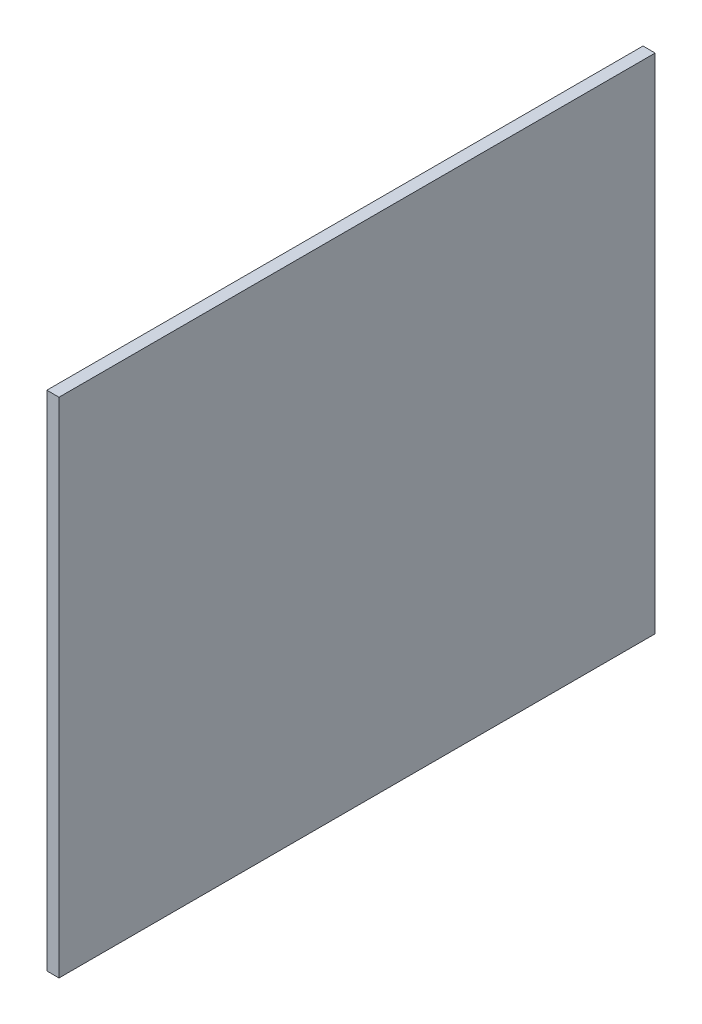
ISO-10303-21;
HEADER;
FILE_DESCRIPTION(('STEP AP214'),'2;1');
FILE_NAME('part.step','',(''),(''),'','','');
FILE_SCHEMA(('AUTOMOTIVE_DESIGN { 1 0 10303 214 1 1 1 1 }'));
ENDSEC;
DATA;
#1=APPLICATION_CONTEXT('core data for automotive mechanical design processes');
#2=APPLICATION_PROTOCOL_DEFINITION('international standard','automotive_design',2000,#1);
#3=PRODUCT_CONTEXT('',#1,'mechanical');
#4=PRODUCT('Part','Part','',(#3));
#5=PRODUCT_RELATED_PRODUCT_CATEGORY('part','',(#4));
#6=PRODUCT_DEFINITION_FORMATION('','',#4);
#7=PRODUCT_DEFINITION_CONTEXT('part definition',#1,'design');
#8=PRODUCT_DEFINITION('design','',#6,#7);
#9=PRODUCT_DEFINITION_SHAPE('','',#8);
#10=(LENGTH_UNIT() NAMED_UNIT(*) SI_UNIT(.MILLI.,.METRE.));
#11=(NAMED_UNIT(*) PLANE_ANGLE_UNIT() SI_UNIT($,.RADIAN.));
#12=(NAMED_UNIT(*) SI_UNIT($,.STERADIAN.) SOLID_ANGLE_UNIT());
#13=UNCERTAINTY_MEASURE_WITH_UNIT(LENGTH_MEASURE(1.E-05),#10,'distance_accuracy_value','');
#14=(GEOMETRIC_REPRESENTATION_CONTEXT(3) GLOBAL_UNCERTAINTY_ASSIGNED_CONTEXT((#13)) GLOBAL_UNIT_ASSIGNED_CONTEXT((#10,
#11,#12)) REPRESENTATION_CONTEXT('',''));
#15=CARTESIAN_POINT('',(0.,0.,0.));
#16=DIRECTION('',(0.,0.,1.));
#17=DIRECTION('',(1.,0.,0.));
#18=AXIS2_PLACEMENT_3D('',#15,#16,#17);
#19=CARTESIAN_POINT('',(12.7,0.,0.));
#20=DIRECTION('',(0.,0.,-1.));
#21=DIRECTION('',(-1.,0.,0.));
#22=AXIS2_PLACEMENT_3D('',#19,#20,#21);
#23=PLANE('',#22);
#24=DIRECTION('',(0.,-1.,0.));
#25=VECTOR('',#24,1.);
#26=CARTESIAN_POINT('',(0.,0.,0.));
#27=LINE('',#26,#25);
#28=CARTESIAN_POINT('',(0.,525.018,0.));
#29=VERTEX_POINT('',#28);
#30=CARTESIAN_POINT('',(0.,0.,0.));
#31=VERTEX_POINT('',#30);
#32=EDGE_CURVE('E83',#29,#31,#27,.T.);
#33=ORIENTED_EDGE('',*,*,#32,.T.);
#34=DIRECTION('',(-1.,0.,0.));
#35=VECTOR('',#34,1.);
#36=CARTESIAN_POINT('',(12.7,0.,0.));
#37=LINE('',#36,#35);
#38=CARTESIAN_POINT('',(12.7,0.,0.));
#39=VERTEX_POINT('',#38);
#40=EDGE_CURVE('E39',#39,#31,#37,.T.);
#41=ORIENTED_EDGE('',*,*,#40,.F.);
#42=DIRECTION('',(0.,-1.,0.));
#43=VECTOR('',#42,1.);
#44=CARTESIAN_POINT('',(12.7,0.,0.));
#45=LINE('',#44,#43);
#46=CARTESIAN_POINT('',(12.7,525.018,0.));
#47=VERTEX_POINT('',#46);
#48=EDGE_CURVE('E77',#47,#39,#45,.T.);
#49=ORIENTED_EDGE('',*,*,#48,.F.);
#50=DIRECTION('',(-1.,0.,0.));
#51=VECTOR('',#50,1.);
#52=CARTESIAN_POINT('',(12.7,525.018,0.));
#53=LINE('',#52,#51);
#54=EDGE_CURVE('E71',#47,#29,#53,.T.);
#55=ORIENTED_EDGE('',*,*,#54,.T.);
#56=EDGE_LOOP('',(#33,#41,#49,#55));
#57=FACE_BOUND('',#56,.T.);
#58=ADVANCED_FACE('F32',(#57),#23,.F.);
#59=CARTESIAN_POINT('',(12.7,0.,0.));
#60=DIRECTION('',(0.,1.,0.));
#61=DIRECTION('',(0.,0.,1.));
#62=AXIS2_PLACEMENT_3D('',#59,#60,#61);
#63=PLANE('',#62);
#64=DIRECTION('',(0.,0.,-1.));
#65=VECTOR('',#64,1.);
#66=CARTESIAN_POINT('',(0.,0.,0.));
#67=LINE('',#66,#65);
#68=CARTESIAN_POINT('',(0.,0.,-622.3));
#69=VERTEX_POINT('',#68);
#70=EDGE_CURVE('E78',#31,#69,#67,.T.);
#71=ORIENTED_EDGE('',*,*,#70,.T.);
#72=DIRECTION('',(1.,0.,0.));
#73=VECTOR('',#72,1.);
#74=CARTESIAN_POINT('',(12.7,0.,-622.3));
#75=LINE('',#74,#73);
#76=CARTESIAN_POINT('',(12.7,2.22044604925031E-13,-622.3));
#77=VERTEX_POINT('',#76);
#78=EDGE_CURVE('E45',#69,#77,#75,.T.);
#79=ORIENTED_EDGE('',*,*,#78,.T.);
#80=DIRECTION('',(0.,0.,-1.));
#81=VECTOR('',#80,1.);
#82=CARTESIAN_POINT('',(12.7,0.,0.));
#83=LINE('',#82,#81);
#84=EDGE_CURVE('E96',#39,#77,#83,.T.);
#85=ORIENTED_EDGE('',*,*,#84,.F.);
#86=ORIENTED_EDGE('',*,*,#40,.T.);
#87=EDGE_LOOP('',(#71,#79,#85,#86));
#88=FACE_BOUND('',#87,.T.);
#89=ADVANCED_FACE('F94',(#88),#63,.F.);
#90=CARTESIAN_POINT('',(12.7,525.018,0.));
#91=DIRECTION('',(0.,-1.,0.));
#92=DIRECTION('',(0.,0.,-1.));
#93=AXIS2_PLACEMENT_3D('',#90,#91,#92);
#94=PLANE('',#93);
#95=DIRECTION('',(0.,0.,1.));
#96=VECTOR('',#95,1.);
#97=CARTESIAN_POINT('',(12.7,525.018,0.));
#98=LINE('',#97,#96);
#99=CARTESIAN_POINT('',(12.7,525.018,-622.3));
#100=VERTEX_POINT('',#99);
#101=EDGE_CURVE('E54',#100,#47,#98,.T.);
#102=ORIENTED_EDGE('',*,*,#101,.F.);
#103=DIRECTION('',(-1.,0.,0.));
#104=VECTOR('',#103,1.);
#105=CARTESIAN_POINT('',(12.7,525.018,-622.3));
#106=LINE('',#105,#104);
#107=CARTESIAN_POINT('',(0.,525.018,-622.3));
#108=VERTEX_POINT('',#107);
#109=EDGE_CURVE('E74',#100,#108,#106,.T.);
#110=ORIENTED_EDGE('',*,*,#109,.T.);
#111=DIRECTION('',(0.,0.,1.));
#112=VECTOR('',#111,1.);
#113=CARTESIAN_POINT('',(0.,525.018,0.));
#114=LINE('',#113,#112);
#115=EDGE_CURVE('E68',#108,#29,#114,.T.);
#116=ORIENTED_EDGE('',*,*,#115,.T.);
#117=ORIENTED_EDGE('',*,*,#54,.F.);
#118=EDGE_LOOP('',(#102,#110,#116,#117));
#119=FACE_BOUND('',#118,.T.);
#120=ADVANCED_FACE('F70',(#119),#94,.F.);
#121=CARTESIAN_POINT('',(12.7,525.018,0.));
#122=DIRECTION('',(-1.,0.,0.));
#123=DIRECTION('',(0.,0.,1.));
#124=AXIS2_PLACEMENT_3D('',#121,#122,#123);
#125=PLANE('',#124);
#126=ORIENTED_EDGE('',*,*,#84,.T.);
#127=DIRECTION('',(0.,-1.,0.));
#128=VECTOR('',#127,1.);
#129=CARTESIAN_POINT('',(12.7,590.61507356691,-622.3));
#130=LINE('',#129,#128);
#131=EDGE_CURVE('E102',#100,#77,#130,.T.);
#132=ORIENTED_EDGE('',*,*,#131,.F.);
#133=ORIENTED_EDGE('',*,*,#101,.T.);
#134=ORIENTED_EDGE('',*,*,#48,.T.);
#135=EDGE_LOOP('',(#126,#132,#133,#134));
#136=FACE_BOUND('',#135,.T.);
#137=ADVANCED_FACE('F98',(#136),#125,.F.);
#138=CARTESIAN_POINT('',(0.,525.018,0.));
#139=DIRECTION('',(-1.,0.,0.));
#140=DIRECTION('',(0.,0.,1.));
#141=AXIS2_PLACEMENT_3D('',#138,#139,#140);
#142=PLANE('',#141);
#143=DIRECTION('',(0.,1.,0.));
#144=VECTOR('',#143,1.);
#145=CARTESIAN_POINT('',(0.,525.018,-622.3));
#146=LINE('',#145,#144);
#147=EDGE_CURVE('E11',#69,#108,#146,.T.);
#148=ORIENTED_EDGE('',*,*,#147,.F.);
#149=ORIENTED_EDGE('',*,*,#70,.F.);
#150=ORIENTED_EDGE('',*,*,#32,.F.);
#151=ORIENTED_EDGE('',*,*,#115,.F.);
#152=EDGE_LOOP('',(#148,#149,#150,#151));
#153=FACE_BOUND('',#152,.T.);
#154=ADVANCED_FACE('F85',(#153),#142,.T.);
#155=CARTESIAN_POINT('',(0.,590.61507356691,-622.3));
#156=DIRECTION('',(0.,0.,1.));
#157=DIRECTION('',(1.,0.,0.));
#158=AXIS2_PLACEMENT_3D('',#155,#156,#157);
#159=PLANE('',#158);
#160=ORIENTED_EDGE('',*,*,#147,.T.);
#161=ORIENTED_EDGE('',*,*,#109,.F.);
#162=ORIENTED_EDGE('',*,*,#131,.T.);
#163=ORIENTED_EDGE('',*,*,#78,.F.);
#164=EDGE_LOOP('',(#160,#161,#162,#163));
#165=FACE_BOUND('',#164,.T.);
#166=ADVANCED_FACE('F103',(#165),#159,.F.);
#167=CLOSED_SHELL('',(#58,#89,#120,#137,#154,#166));
#168=MANIFOLD_SOLID_BREP('B2',#167);
#169=ADVANCED_BREP_SHAPE_REPRESENTATION('',(#18,#168),#14);
#170=SHAPE_DEFINITION_REPRESENTATION(#9,#169);
ENDSEC;
END-ISO-10303-21;
